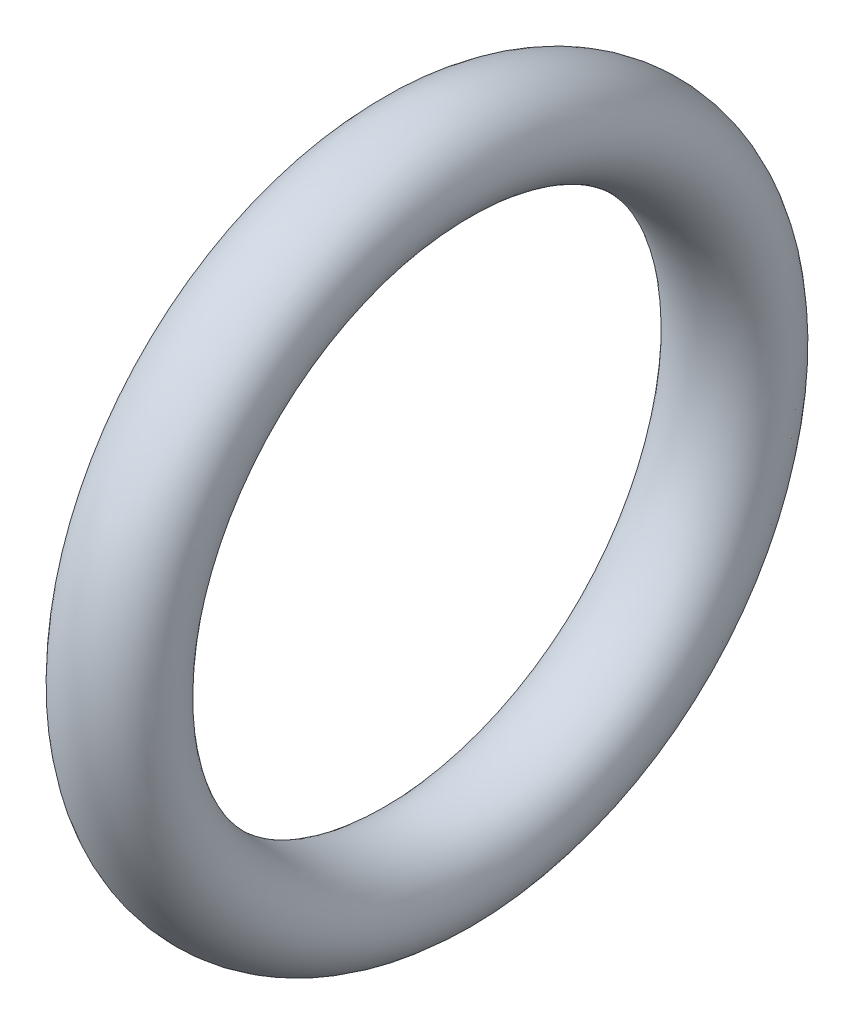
from build123d import *

# Parameters (mm, degrees)
ESQUISSE1_RX = 0.95
ESQUISSE1_RY = 0.8


with BuildPart() as part:
    # Esquisse1 → R_volution1 (revolve)
    with BuildSketch(Plane.XY):
        with Locations((0, 5.2)):
            Ellipse(ESQUISSE1_RX, ESQUISSE1_RY)
    revolve(axis=Axis((-5.348863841, 0, 0), (1, 0, 0)))


solid = part.part
